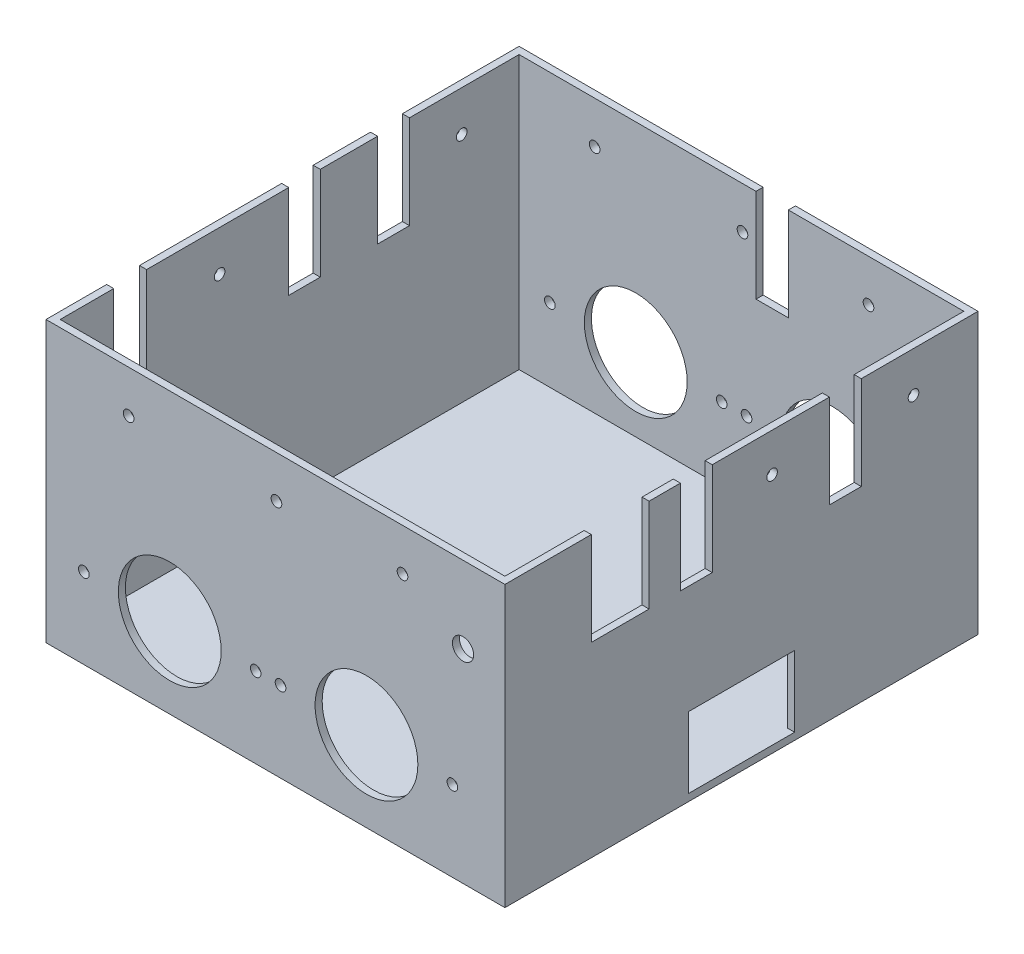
from build123d import *

# Parameters (mm, degrees)
SKETCH_1_W           = 127.5
SKETCH_1_H           = 131.5
EXTRUDE_1_DEPTH      = 2
EXTRUDE_2_DEPTH      = 90
EXTRUDE_3_DEPTH      = 90
EXTRUDE_3_DEPTH_BACK = 2
SKETCH_3_W           = 129.5
SKETCH_3_H           = 133.5
SKETCH_4_W           = 129.5
SKETCH_4_H           = 13
CUT_EXTRUDE_1_DEPTH  = 151
SKETCH_5_W           = 16.307982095
SKETCH_5_H           = 26.358869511
SKETCH_5_W_2         = 9
CUT_EXTRUDE_2_DEPTH  = 15
SKETCH_6_W           = 9
SKETCH_6_H           = 26.358869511
SKETCH_6_W_2         = 9.271966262
SKETCH_6_W_3         = 8.893227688
CUT_EXTRUDE_3_DEPTH  = 15
SKETCH_7_W           = 9.117477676
SKETCH_7_H           = 2
SKETCH_7_H_2         = 24.358869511
CUT_EXTRUDE_4_DEPTH  = 15
SKETCH_8_R           = 1.5
CUT_EXTRUDE_5_DEPTH  = 15
SKETCH_9_R           = 1.5
CUT_EXTRUDE_6_DEPTH  = 15
CUT_EXTRUDE_START    = -155
SKETCH_10_R          = 1.5
CUT_EXTRUDE_7_DEPTH  = 155
CUT_EXTRUDE_START_2  = -79
SKETCH_11_R          = 1.5
CUT_EXTRUDE_8_DEPTH  = 79
SKETCH_12_W          = 10
SKETCH_12_H          = 10
CUT_EXTRUDE_9_DEPTH  = 188
SKETCH_13_W          = 10
SKETCH_13_H          = 10
CUT_EXTRUDE_10_DEPTH = 188
SKETCH_14_W          = 20
SKETCH_14_H          = 10
EXTRUDE_4_DEPTH      = 2
SKETCH_15_W          = 20
SKETCH_15_H          = 10
EXTRUDE_5_DEPTH      = 2
SKETCH_16_W          = 20
SKETCH_16_H          = 10
EXTRUDE_6_DEPTH      = 2
CUT_EXTRUDE_11_DEPTH = 2
SKETCH_18_R          = 14.510238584
SKETCH_18_R_2        = 1.5
SKETCH_18_R_3        = 14.5
CUT_EXTRUDE_12_DEPTH = 150
SKETCH_19_R          = 3
CUT_EXTRUDE_13_DEPTH = 10


with BuildPart() as part:
    # Sketch 1 → Extrude 1 (new body)
    with BuildSketch(Plane(origin=(0, 0, 0), x_dir=(1, 0, 0), z_dir=(0, 1, 0))):
        with Locations((63.75, 65.75)):
            Rectangle(SKETCH_1_W, SKETCH_1_H)
    extrude(amount=EXTRUDE_1_DEPTH)

    # Sketch 2 → Extrude 2 (add)
    with BuildSketch(Plane(origin=(0, 2, 0), x_dir=(1, 0, 0), z_dir=(0, 1, 0))):
        Polygon((126.5, 130.468627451), (127.5, 131.5), (0, 131.5), (0, 0), (1, 1.031372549), (1, 130.5), (126.5, 130.5), align=None)
        Polygon((127.5, 0), (127.5, 131.5), (126.5, 130.468627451), (126.5, 1), (1, 1), (1, 1.031372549), (0, 0), align=None)
    extrude(amount=EXTRUDE_2_DEPTH)

    # Sketch 3 → Extrude 3 (add, two sides: drawn at the far end of the back side and taken through both)
    with BuildSketch(Plane(origin=(0, 2, 0), x_dir=(1, 0, 0), z_dir=(0, 1, 0)).offset(-EXTRUDE_3_DEPTH_BACK)):
        with Locations((63.75, 65.75)):
            Rectangle(SKETCH_3_W, SKETCH_3_H)
        Polygon((126.5, 130.5), (126.5, 130.468627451), (126.5, 1), (1, 1), (1, 1.031372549), (1, 130.5), align=None, mode=Mode.SUBTRACT)
    extrude(amount=EXTRUDE_3_DEPTH + EXTRUDE_3_DEPTH_BACK)

    # Sketch 4 → Cut-Extrude 1 (cut)
    with BuildSketch(Plane.XY.offset(1)):
        with Locations((63.75, 85.5)):
            Rectangle(SKETCH_4_W, SKETCH_4_H)
    extrude(amount=-CUT_EXTRUDE_1_DEPTH, mode=Mode.SUBTRACT)

    # Sketch 5 → Cut-Extrude 2 (cut)
    with BuildSketch(Plane(origin=(128.5, 0, 0), x_dir=(0, 0, -1), z_dir=(1, 0, 0))):
        with Locations((31.53111697, 65.820565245)):
            Rectangle(SKETCH_5_W, SKETCH_5_H)
        with Locations((53.009500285, 65.820565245)):
            Rectangle(SKETCH_5_W_2, SKETCH_5_H)
        with Locations((95.067208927, 65.820565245)):
            Rectangle(SKETCH_5_W_2, SKETCH_5_H)
    extrude(amount=-CUT_EXTRUDE_2_DEPTH, mode=Mode.SUBTRACT)

    # Sketch 6 → Cut-Extrude 3 (cut)
    with BuildSketch(Plane.ZY.offset(1)):
        with Locations((-95.067208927, 65.820565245)):
            Rectangle(SKETCH_6_W, SKETCH_6_H)
        with Locations((-20.750531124, 65.820565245)):
            Rectangle(SKETCH_6_W_2, SKETCH_6_H)
        with Locations((-69.946613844, 65.820565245)):
            Rectangle(SKETCH_6_W_3, SKETCH_6_H)
    extrude(amount=-CUT_EXTRUDE_3_DEPTH, mode=Mode.SUBTRACT)

    # Sketch 7 → Cut-Extrude 4 (cut)
    with BuildSketch(Plane(origin=(0, 0, -132.5), x_dir=(-1, 0, 0), z_dir=(0, 0, -1))):
        with Locations((-72.423193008, 53.641130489)):
            Rectangle(SKETCH_7_W, SKETCH_7_H)
        with Locations((-72.423193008, 66.820565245)):
            Rectangle(SKETCH_7_W, SKETCH_7_H_2)
    extrude(amount=-CUT_EXTRUDE_4_DEPTH, mode=Mode.SUBTRACT)

    # Sketch 8 → Cut-Extrude 5 (cut)
    with BuildSketch(Plane.XY.offset(1)):
        with Locations((64.039171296, 67.099251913)):
            Circle(SKETCH_8_R)
    extrude(amount=-CUT_EXTRUDE_5_DEPTH, mode=Mode.SUBTRACT)

    # Sketch 9 → Cut-Extrude 6 (cut)
    with BuildSketch(Plane.ZY.offset(1)):
        with Locations((-45.990956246, 67.552820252)):
            Circle(SKETCH_9_R)
        with Locations((-114.304301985, 67.552820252)):
            Circle(SKETCH_9_R)
    extrude(amount=-CUT_EXTRUDE_6_DEPTH, mode=Mode.SUBTRACT)

    # Sketch 10 → Cut-Extrude 7 (cut)
    with BuildSketch(Plane(origin=(0, 0, -132.5), x_dir=(-1, 0, 0), z_dir=(0, 0, -1)).offset(CUT_EXTRUDE_START)):
        with Locations(Location((-64.039171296, 67.099251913, 0), (0, 0, 180))):
            Circle(SKETCH_10_R)
        with Locations((-99.598450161, 67.099251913)):
            Circle(SKETCH_10_R)
        with Locations((-22.320810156, 67.099251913)):
            Circle(SKETCH_10_R)
    extrude(amount=CUT_EXTRUDE_7_DEPTH, mode=Mode.SUBTRACT)

    # Sketch 11 → Cut-Extrude 8 (cut)
    with BuildSketch(Plane(origin=(128.5, 0, 0), x_dir=(0, 0, -1), z_dir=(1, 0, 0)).offset(CUT_EXTRUDE_START_2)):
        with Locations((74.393227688, 68.116864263)):
            Circle(SKETCH_11_R)
        with Locations(Location((114.304301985, 67.552820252, 0), (0, 0, 180))):
            Circle(SKETCH_11_R)
    extrude(amount=CUT_EXTRUDE_8_DEPTH, mode=Mode.SUBTRACT)

    # Sketch 12 → Cut-Extrude 9 (cut)
    with BuildSketch(Plane.XY.offset(1)):
        with Locations((58.75, 7)):
            Rectangle(SKETCH_12_W, SKETCH_12_H)
        with Locations((68.75, 7)):
            Rectangle(SKETCH_12_W, SKETCH_12_H)
    extrude(amount=-CUT_EXTRUDE_9_DEPTH, mode=Mode.SUBTRACT)

    # Sketch 13 → Cut-Extrude 10 (cut)
    with BuildSketch(Plane.ZY.offset(1)):
        with Locations((-70.75, 7)):
            Rectangle(SKETCH_13_W, SKETCH_13_H)
        with Locations((-60.75, 7)):
            Rectangle(SKETCH_13_W, SKETCH_13_H)
    extrude(amount=-CUT_EXTRUDE_10_DEPTH, mode=Mode.SUBTRACT)

    # Sketch 14 → Extrude 4 (add)
    with BuildSketch(Plane.XY.offset(1)):
        with Locations((63.75, 7)):
            Rectangle(SKETCH_14_W, SKETCH_14_H)
    extrude(amount=-EXTRUDE_4_DEPTH)

    # Sketch 15 → Extrude 5 (add)
    with BuildSketch(Plane(origin=(0, 0, -132.5), x_dir=(-1, 0, 0), z_dir=(0, 0, -1))):
        with Locations((-63.75, 7)):
            Rectangle(SKETCH_15_W, SKETCH_15_H)
    extrude(amount=-EXTRUDE_5_DEPTH)

    # Sketch 16 → Extrude 6 (add)
    with BuildSketch(Plane.ZY.offset(1)):
        with Locations((-65.75, 7)):
            Rectangle(SKETCH_16_W, SKETCH_16_H)
    extrude(amount=-EXTRUDE_6_DEPTH)

    # Sketch 17 → Cut-Extrude 11 (cut)
    with BuildSketch(Plane(origin=(128.5, 0, 0), x_dir=(0, 0, -1), z_dir=(1, 0, 0))):
        Polygon((75.75, 12), (75.75, 2), (80.75, 2), (80.75, 22), (50.75, 22), (50.75, 2), (55.75, 2), (55.75, 12), align=None)
    extrude(amount=-CUT_EXTRUDE_11_DEPTH, mode=Mode.SUBTRACT)

    # Sketch 18 → Cut-Extrude 12 (cut)
    with BuildSketch(Plane.XY.offset(1)):
        with Locations((33.923976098, 22.70502338)):
            Circle(SKETCH_18_R)
        with Locations((58.177266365, 22.695327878)):
            Circle(SKETCH_18_R_2)
        with Locations((9.677266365, 22.695327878)):
            Circle(SKETCH_18_R_2)
        with Locations((65.183106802, 22.695327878)):
            Circle(SKETCH_18_R_2)
        with Locations((113.683106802, 22.695327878)):
            Circle(SKETCH_18_R_2)
        with Locations((89.433106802, 22.695327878)):
            Circle(SKETCH_18_R_3)
    extrude(amount=-CUT_EXTRUDE_12_DEPTH, mode=Mode.SUBTRACT)

    # Sketch 19 → Cut-Extrude 13 (cut)
    with BuildSketch(Plane.XY.offset(1)):
        with Locations((116.674506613, 57.335660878)):
            Circle(SKETCH_19_R)
    extrude(amount=-CUT_EXTRUDE_13_DEPTH, mode=Mode.SUBTRACT)


solid = part.part
